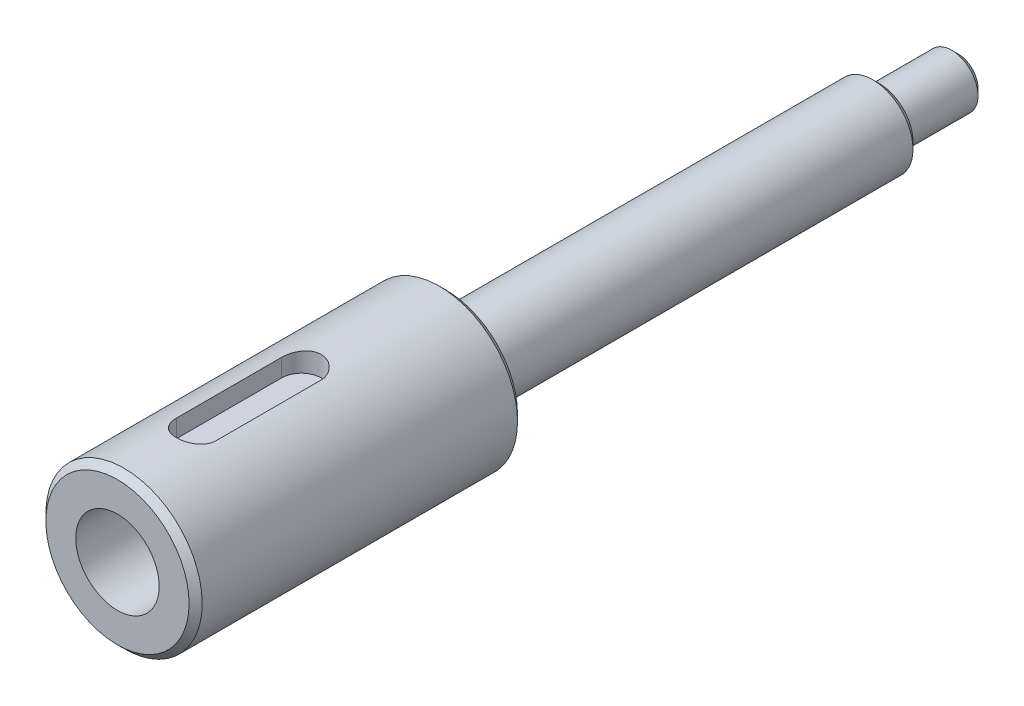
from build123d import *

# Parameters (mm, degrees)
SKETCH1_R                          = 5.95
BASE_EXTRUDE_DEPTH                 = 25
SKETCH3_R                          = 3.05
BOSS_EXTRUDE1_DEPTH                = 39
CHAMFER1_SIZE                      = 0.5
CUT_EXTRUDE2_DEPTH                 = 1.6
M6_0_6_000000_DIAMETER_HOLE1_D     = 6.35
M6_0_6_000000_DIAMETER_HOLE1_DEPTH = 21.5
M6_0_6_000000_DIAMETER_HOLE1_TIP   = 1.907732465
CUT_EXTRUDE3_START                 = -6
SKETCH10_R                         = 3.05
SKETCH10_R_2                       = 2
CUT_EXTRUDE3_DEPTH                 = 6
CHAMFER2_SIZE                      = 0.5
SKETCH11_R                         = 0.75
CUT_EXTRUDE4_DEPTH                 = 10


with BuildPart() as part:
    # Sketch1 → Base-Extrude (new body)
    with BuildSketch(Plane.XY):
        Circle(SKETCH1_R)
    extrude(amount=BASE_EXTRUDE_DEPTH)

    # Sketch3 → Boss-Extrude1 (add)
    with BuildSketch(Plane(origin=(0, 0, 0), x_dir=(-1, 0, 0), z_dir=(0, 0, -1))):
        with Locations(Location((0, 0, 0), (0, 0, 180))):
            Circle(SKETCH3_R)
    extrude(amount=BOSS_EXTRUDE1_DEPTH)

    # Chamfer1
    chamfer1_edges = [part.edges().sort_by_distance(p)[0] for p in [
        (-5.95, 0, 0),
        (-5.95, 0, 25),
    ]]
    chamfer(chamfer1_edges, length=CHAMFER1_SIZE)

    # Sketch7 → Cut-Extrude2 (cut)
    with BuildSketch(Plane(origin=(0, 6, 0), x_dir=(-1, 0, 0), z_dir=(0, 1, 0))):
        with BuildLine():
            Line((-1.5, 19), (-1.5, 11))
            ThreePointArc((-1.5, 11), (0, 9.5), (1.5, 11))
            Line((1.5, 11), (1.5, 19))
            ThreePointArc((1.5, 19), (0, 20.5), (-1.5, 19))
        make_face()
    extrude(amount=-CUT_EXTRUDE2_DEPTH, mode=Mode.SUBTRACT)

    # M6.0 _6.000000_ Diameter Hole1
    with Locations(Plane.XY.offset(25)):
        with Locations((0, 0)):
            Hole(M6_0_6_000000_DIAMETER_HOLE1_D / 2, depth=M6_0_6_000000_DIAMETER_HOLE1_DEPTH)
            with Locations((0, 0, -(M6_0_6_000000_DIAMETER_HOLE1_DEPTH + M6_0_6_000000_DIAMETER_HOLE1_TIP / 2))):  # 118° drill point
                Cone(0, M6_0_6_000000_DIAMETER_HOLE1_D / 2, M6_0_6_000000_DIAMETER_HOLE1_TIP, mode=Mode.SUBTRACT)

    # Sketch10 → Cut-Extrude3 (cut)
    with BuildSketch(Plane(origin=(0, 0, -39), x_dir=(-1, 0, 0), z_dir=(0, 0, -1)).offset(CUT_EXTRUDE3_START)):
        with Locations(Location((0, 0, 0), (0, 0, 180))):
            Circle(SKETCH10_R)
        Circle(SKETCH10_R_2, mode=Mode.SUBTRACT)
    extrude(amount=CUT_EXTRUDE3_DEPTH, mode=Mode.SUBTRACT)

    # Chamfer2
    chamfer2_edges = [part.edges().sort_by_distance(p)[0] for p in [
        (-3.05, 0, -33),
        (2, 0, -39),
    ]]
    chamfer(chamfer2_edges, length=CHAMFER2_SIZE)

    # Sketch11 → Cut-Extrude4 (cut)
    with BuildSketch(Plane(origin=(0, 0, 0), x_dir=(0, 0, -1), z_dir=(0, 1, 0))):
        with Locations(Location((-2.75, 0, 0), (0, 0, 179.999999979))):
            Circle(SKETCH11_R)
    extrude(amount=-CUT_EXTRUDE4_DEPTH, mode=Mode.SUBTRACT)


solid = part.part
